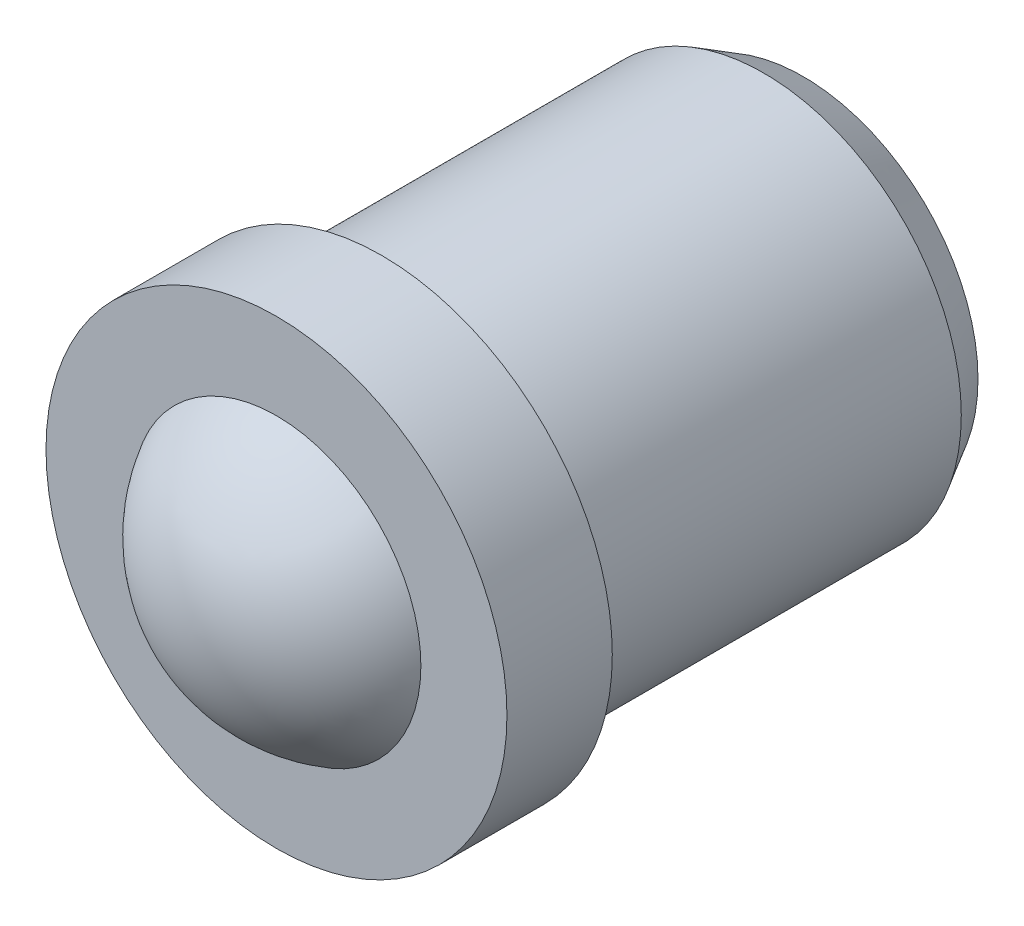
ISO-10303-21;
HEADER;
FILE_DESCRIPTION(('STEP AP214'),'2;1');
FILE_NAME('part.step','',(''),(''),'','','');
FILE_SCHEMA(('AUTOMOTIVE_DESIGN { 1 0 10303 214 1 1 1 1 }'));
ENDSEC;
DATA;
#1=APPLICATION_CONTEXT('core data for automotive mechanical design processes');
#2=APPLICATION_PROTOCOL_DEFINITION('international standard','automotive_design',2000,#1);
#3=PRODUCT_CONTEXT('',#1,'mechanical');
#4=PRODUCT('Part','Part','',(#3));
#5=PRODUCT_RELATED_PRODUCT_CATEGORY('part','',(#4));
#6=PRODUCT_DEFINITION_FORMATION('','',#4);
#7=PRODUCT_DEFINITION_CONTEXT('part definition',#1,'design');
#8=PRODUCT_DEFINITION('design','',#6,#7);
#9=PRODUCT_DEFINITION_SHAPE('','',#8);
#10=(LENGTH_UNIT() NAMED_UNIT(*) SI_UNIT(.MILLI.,.METRE.));
#11=(NAMED_UNIT(*) PLANE_ANGLE_UNIT() SI_UNIT($,.RADIAN.));
#12=(NAMED_UNIT(*) SI_UNIT($,.STERADIAN.) SOLID_ANGLE_UNIT());
#13=UNCERTAINTY_MEASURE_WITH_UNIT(LENGTH_MEASURE(1.E-05),#10,'distance_accuracy_value','');
#14=(GEOMETRIC_REPRESENTATION_CONTEXT(3) GLOBAL_UNCERTAINTY_ASSIGNED_CONTEXT((#13)) GLOBAL_UNIT_ASSIGNED_CONTEXT((#10,
#11,#12)) REPRESENTATION_CONTEXT('',''));
#15=CARTESIAN_POINT('',(0.,0.,0.));
#16=DIRECTION('',(0.,0.,1.));
#17=DIRECTION('',(1.,0.,0.));
#18=AXIS2_PLACEMENT_3D('',#15,#16,#17);
#19=CARTESIAN_POINT('',(-1.75,0.,0.8));
#20=DIRECTION('',(0.,0.,-1.));
#21=DIRECTION('',(1.,0.,0.));
#22=AXIS2_PLACEMENT_3D('',#19,#20,#21);
#23=PLANE('',#22);
#24=CARTESIAN_POINT('',(0.,0.,0.8));
#25=DIRECTION('',(0.,0.,-1.));
#26=DIRECTION('',(1.,0.,0.));
#27=AXIS2_PLACEMENT_3D('',#24,#25,#26);
#28=CIRCLE('',#27,1.75);
#29=CARTESIAN_POINT('',(1.75,0.,0.8));
#30=VERTEX_POINT('',#29);
#31=EDGE_CURVE('E36',#30,#30,#28,.T.);
#32=ORIENTED_EDGE('',*,*,#31,.F.);
#33=EDGE_LOOP('',(#32));
#34=FACE_BOUND('',#33,.T.);
#35=CARTESIAN_POINT('',(0.,0.,0.8));
#36=DIRECTION('',(0.,0.,1.));
#37=DIRECTION('',(0.,-1.,0.));
#38=AXIS2_PLACEMENT_3D('',#35,#36,#37);
#39=CIRCLE('',#38,1.09658560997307);
#40=CARTESIAN_POINT('',(0.,-1.09658560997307,0.8));
#41=VERTEX_POINT('',#40);
#42=EDGE_CURVE('E8',#41,#41,#39,.F.);
#43=ORIENTED_EDGE('',*,*,#42,.T.);
#44=EDGE_LOOP('',(#43));
#45=FACE_BOUND('',#44,.T.);
#46=ADVANCED_FACE('F12',(#34,#45),#23,.F.);
#47=CARTESIAN_POINT('',(0.,0.,0.8));
#48=DIRECTION('',(0.,0.,-1.));
#49=DIRECTION('',(1.,0.,0.));
#50=AXIS2_PLACEMENT_3D('',#47,#48,#49);
#51=CYLINDRICAL_SURFACE('',#50,1.75);
#52=CARTESIAN_POINT('',(0.,0.,0.));
#53=DIRECTION('',(0.,0.,-1.));
#54=DIRECTION('',(1.,0.,0.));
#55=AXIS2_PLACEMENT_3D('',#52,#53,#54);
#56=CIRCLE('',#55,1.75);
#57=CARTESIAN_POINT('',(1.75,0.,0.));
#58=VERTEX_POINT('',#57);
#59=EDGE_CURVE('E34',#58,#58,#56,.F.);
#60=ORIENTED_EDGE('',*,*,#59,.T.);
#61=EDGE_LOOP('',(#60));
#62=FACE_BOUND('',#61,.T.);
#63=ORIENTED_EDGE('',*,*,#31,.T.);
#64=EDGE_LOOP('',(#63));
#65=FACE_BOUND('',#64,.T.);
#66=ADVANCED_FACE('F40',(#62,#65),#51,.T.);
#67=CARTESIAN_POINT('',(0.,0.,-3.2));
#68=DIRECTION('',(0.,0.,1.));
#69=DIRECTION('',(-1.,0.,0.));
#70=AXIS2_PLACEMENT_3D('',#67,#68,#69);
#71=PLANE('',#70);
#72=CARTESIAN_POINT('',(0.,0.,-3.19999999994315));
#73=DIRECTION('',(0.,0.,1.));
#74=DIRECTION('',(-1.,0.,0.));
#75=AXIS2_PLACEMENT_3D('',#72,#73,#74);
#76=CIRCLE('',#75,1.32679491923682);
#77=CARTESIAN_POINT('',(-1.32679491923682,0.,-3.19999999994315));
#78=VERTEX_POINT('',#77);
#79=EDGE_CURVE('E27',#78,#78,#76,.T.);
#80=ORIENTED_EDGE('',*,*,#79,.F.);
#81=EDGE_LOOP('',(#80));
#82=FACE_BOUND('',#81,.T.);
#83=ADVANCED_FACE('F49',(#82),#71,.F.);
#84=CARTESIAN_POINT('',(-1.5,0.,0.));
#85=DIRECTION('',(0.,0.,1.));
#86=DIRECTION('',(-1.,0.,0.));
#87=AXIS2_PLACEMENT_3D('',#84,#85,#86);
#88=PLANE('',#87);
#89=CARTESIAN_POINT('',(0.,0.,0.));
#90=DIRECTION('',(0.,0.,-1.));
#91=DIRECTION('',(1.,0.,0.));
#92=AXIS2_PLACEMENT_3D('',#89,#90,#91);
#93=CIRCLE('',#92,1.5);
#94=CARTESIAN_POINT('',(1.5,0.,0.));
#95=VERTEX_POINT('',#94);
#96=EDGE_CURVE('E22',#95,#95,#93,.T.);
#97=ORIENTED_EDGE('',*,*,#96,.F.);
#98=EDGE_LOOP('',(#97));
#99=FACE_BOUND('',#98,.T.);
#100=ORIENTED_EDGE('',*,*,#59,.F.);
#101=EDGE_LOOP('',(#100));
#102=FACE_BOUND('',#101,.T.);
#103=ADVANCED_FACE('F63',(#99,#102),#88,.F.);
#104=CARTESIAN_POINT('',(0.,0.,-2.90000000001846));
#105=DIRECTION('',(0.,0.,1.));
#106=DIRECTION('',(-1.,0.,0.));
#107=AXIS2_PLACEMENT_3D('',#104,#105,#106);
#108=CONICAL_SURFACE('',#107,1.49999999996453,0.523598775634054);
#109=ORIENTED_EDGE('',*,*,#79,.T.);
#110=EDGE_LOOP('',(#109));
#111=FACE_BOUND('',#110,.T.);
#112=CARTESIAN_POINT('',(0.,0.,-2.9));
#113=DIRECTION('',(0.,0.,-1.));
#114=DIRECTION('',(1.,0.,0.));
#115=AXIS2_PLACEMENT_3D('',#112,#113,#114);
#116=CIRCLE('',#115,1.5);
#117=CARTESIAN_POINT('',(1.5,0.,-2.9));
#118=VERTEX_POINT('',#117);
#119=EDGE_CURVE('E18',#118,#118,#116,.F.);
#120=ORIENTED_EDGE('',*,*,#119,.F.);
#121=EDGE_LOOP('',(#120));
#122=FACE_BOUND('',#121,.T.);
#123=ADVANCED_FACE('F56',(#111,#122),#108,.T.);
#124=CARTESIAN_POINT('',(0.,0.,0.8));
#125=DIRECTION('',(0.,0.,-1.));
#126=DIRECTION('',(1.,0.,0.));
#127=AXIS2_PLACEMENT_3D('',#124,#125,#126);
#128=CYLINDRICAL_SURFACE('',#127,1.5);
#129=ORIENTED_EDGE('',*,*,#119,.T.);
#130=EDGE_LOOP('',(#129));
#131=FACE_BOUND('',#130,.T.);
#132=ORIENTED_EDGE('',*,*,#96,.T.);
#133=EDGE_LOOP('',(#132));
#134=FACE_BOUND('',#133,.T.);
#135=ADVANCED_FACE('F52',(#131,#134),#128,.T.);
#136=CARTESIAN_POINT('',(0.,0.,0.2));
#137=DIRECTION('',(0.,0.,1.));
#138=DIRECTION('',(1.,0.,0.));
#139=AXIS2_PLACEMENT_3D('',#136,#137,#138);
#140=SPHERICAL_SURFACE('',#139,1.25);
#141=ORIENTED_EDGE('',*,*,#42,.F.);
#142=EDGE_LOOP('',(#141));
#143=FACE_BOUND('',#142,.T.);
#144=ADVANCED_FACE('F43',(#143),#140,.T.);
#145=CLOSED_SHELL('',(#46,#66,#83,#103,#123,#135,#144));
#146=MANIFOLD_SOLID_BREP('B1',#145);
#147=ADVANCED_BREP_SHAPE_REPRESENTATION('',(#18,#146),#14);
#148=SHAPE_DEFINITION_REPRESENTATION(#9,#147);
ENDSEC;
END-ISO-10303-21;
